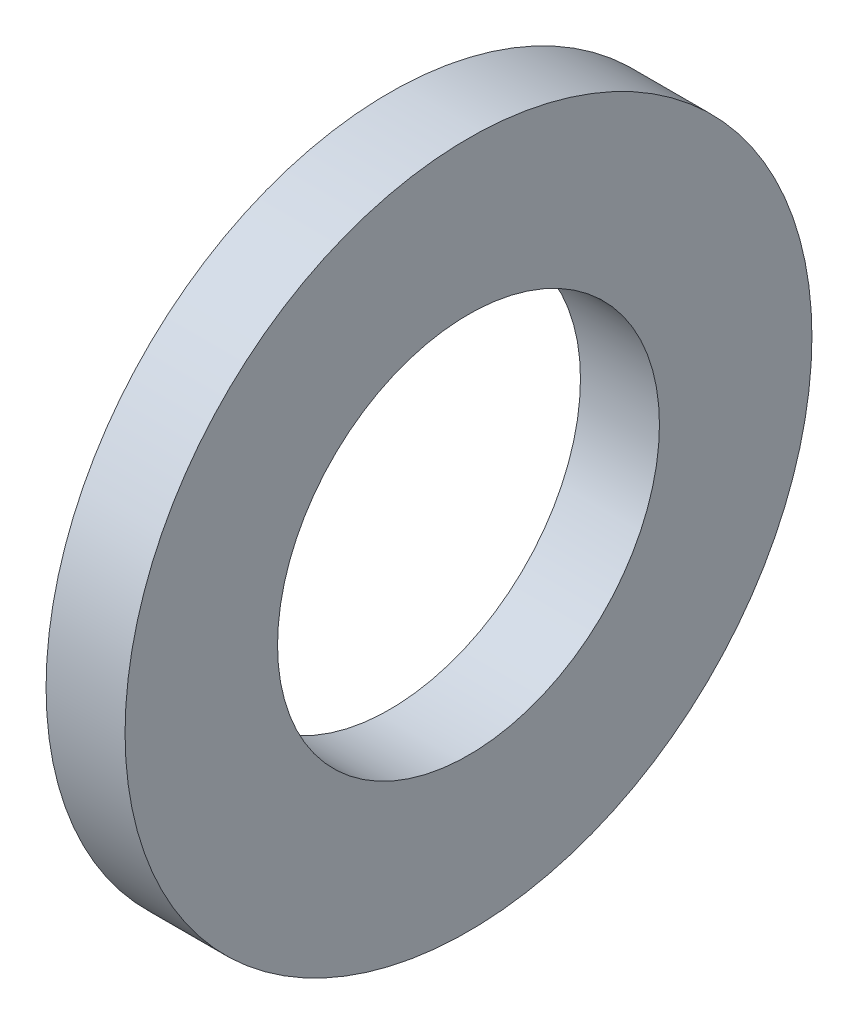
ISO-10303-21;
HEADER;
FILE_DESCRIPTION(('STEP AP214'),'2;1');
FILE_NAME('part.step','',(''),(''),'','','');
FILE_SCHEMA(('AUTOMOTIVE_DESIGN { 1 0 10303 214 1 1 1 1 }'));
ENDSEC;
DATA;
#1=APPLICATION_CONTEXT('core data for automotive mechanical design processes');
#2=APPLICATION_PROTOCOL_DEFINITION('international standard','automotive_design',2000,#1);
#3=PRODUCT_CONTEXT('',#1,'mechanical');
#4=PRODUCT('Part','Part','',(#3));
#5=PRODUCT_RELATED_PRODUCT_CATEGORY('part','',(#4));
#6=PRODUCT_DEFINITION_FORMATION('','',#4);
#7=PRODUCT_DEFINITION_CONTEXT('part definition',#1,'design');
#8=PRODUCT_DEFINITION('design','',#6,#7);
#9=PRODUCT_DEFINITION_SHAPE('','',#8);
#10=(LENGTH_UNIT() NAMED_UNIT(*) SI_UNIT(.MILLI.,.METRE.));
#11=(NAMED_UNIT(*) PLANE_ANGLE_UNIT() SI_UNIT($,.RADIAN.));
#12=(NAMED_UNIT(*) SI_UNIT($,.STERADIAN.) SOLID_ANGLE_UNIT());
#13=UNCERTAINTY_MEASURE_WITH_UNIT(LENGTH_MEASURE(1.E-05),#10,'distance_accuracy_value','');
#14=(GEOMETRIC_REPRESENTATION_CONTEXT(3) GLOBAL_UNCERTAINTY_ASSIGNED_CONTEXT((#13)) GLOBAL_UNIT_ASSIGNED_CONTEXT((#10,
#11,#12)) REPRESENTATION_CONTEXT('',''));
#15=CARTESIAN_POINT('',(0.,0.,0.));
#16=DIRECTION('',(0.,0.,1.));
#17=DIRECTION('',(1.,0.,0.));
#18=AXIS2_PLACEMENT_3D('',#15,#16,#17);
#19=CARTESIAN_POINT('',(-34.9249999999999,0.,0.));
#20=DIRECTION('',(-1.,0.,0.));
#21=DIRECTION('',(0.,0.,1.));
#22=AXIS2_PLACEMENT_3D('',#19,#20,#21);
#23=CYLINDRICAL_SURFACE('',#22,5.56);
#24=CARTESIAN_POINT('',(0.,0.,0.));
#25=DIRECTION('',(-1.,0.,0.));
#26=DIRECTION('',(0.,0.,1.));
#27=AXIS2_PLACEMENT_3D('',#24,#25,#26);
#28=CIRCLE('',#27,5.56);
#29=CARTESIAN_POINT('',(0.,0.,5.56));
#30=VERTEX_POINT('',#29);
#31=EDGE_CURVE('E10',#30,#30,#28,.T.);
#32=ORIENTED_EDGE('',*,*,#31,.F.);
#33=EDGE_LOOP('',(#32));
#34=FACE_BOUND('',#33,.T.);
#35=CARTESIAN_POINT('',(-2.3,0.,0.));
#36=DIRECTION('',(-1.,0.,0.));
#37=DIRECTION('',(0.,0.,1.));
#38=AXIS2_PLACEMENT_3D('',#35,#36,#37);
#39=CIRCLE('',#38,5.56);
#40=CARTESIAN_POINT('',(-2.3,0.,5.56));
#41=VERTEX_POINT('',#40);
#42=EDGE_CURVE('E43',#41,#41,#39,.T.);
#43=ORIENTED_EDGE('',*,*,#42,.T.);
#44=EDGE_LOOP('',(#43));
#45=FACE_BOUND('',#44,.T.);
#46=ADVANCED_FACE('F29',(#34,#45),#23,.F.);
#47=CARTESIAN_POINT('',(0.,5.56,0.));
#48=DIRECTION('',(-1.,0.,0.));
#49=DIRECTION('',(0.,0.,1.));
#50=AXIS2_PLACEMENT_3D('',#47,#48,#49);
#51=PLANE('',#50);
#52=CARTESIAN_POINT('',(0.,0.,0.));
#53=DIRECTION('',(-1.,0.,0.));
#54=DIRECTION('',(0.,0.,1.));
#55=AXIS2_PLACEMENT_3D('',#52,#53,#54);
#56=CIRCLE('',#55,10.);
#57=CARTESIAN_POINT('',(0.,0.,10.));
#58=VERTEX_POINT('',#57);
#59=EDGE_CURVE('E35',#58,#58,#56,.T.);
#60=ORIENTED_EDGE('',*,*,#59,.F.);
#61=EDGE_LOOP('',(#60));
#62=FACE_BOUND('',#61,.T.);
#63=ORIENTED_EDGE('',*,*,#31,.T.);
#64=EDGE_LOOP('',(#63));
#65=FACE_BOUND('',#64,.T.);
#66=ADVANCED_FACE('F58',(#62,#65),#51,.F.);
#67=CARTESIAN_POINT('',(-34.9249999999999,0.,0.));
#68=DIRECTION('',(-1.,0.,0.));
#69=DIRECTION('',(0.,0.,1.));
#70=AXIS2_PLACEMENT_3D('',#67,#68,#69);
#71=CYLINDRICAL_SURFACE('',#70,10.);
#72=CARTESIAN_POINT('',(-2.3,0.,0.));
#73=DIRECTION('',(-1.,0.,0.));
#74=DIRECTION('',(0.,0.,1.));
#75=AXIS2_PLACEMENT_3D('',#72,#73,#74);
#76=CIRCLE('',#75,10.);
#77=CARTESIAN_POINT('',(-2.3,0.,10.));
#78=VERTEX_POINT('',#77);
#79=EDGE_CURVE('E39',#78,#78,#76,.T.);
#80=ORIENTED_EDGE('',*,*,#79,.F.);
#81=EDGE_LOOP('',(#80));
#82=FACE_BOUND('',#81,.T.);
#83=ORIENTED_EDGE('',*,*,#59,.T.);
#84=EDGE_LOOP('',(#83));
#85=FACE_BOUND('',#84,.T.);
#86=ADVANCED_FACE('F53',(#82,#85),#71,.T.);
#87=CARTESIAN_POINT('',(-2.3,10.,0.));
#88=DIRECTION('',(1.,0.,0.));
#89=DIRECTION('',(0.,0.,-1.));
#90=AXIS2_PLACEMENT_3D('',#87,#88,#89);
#91=PLANE('',#90);
#92=ORIENTED_EDGE('',*,*,#42,.F.);
#93=EDGE_LOOP('',(#92));
#94=FACE_BOUND('',#93,.T.);
#95=ORIENTED_EDGE('',*,*,#79,.T.);
#96=EDGE_LOOP('',(#95));
#97=FACE_BOUND('',#96,.T.);
#98=ADVANCED_FACE('F50',(#94,#97),#91,.F.);
#99=CLOSED_SHELL('',(#46,#66,#86,#98));
#100=MANIFOLD_SOLID_BREP('B2',#99);
#101=ADVANCED_BREP_SHAPE_REPRESENTATION('',(#18,#100),#14);
#102=SHAPE_DEFINITION_REPRESENTATION(#9,#101);
ENDSEC;
END-ISO-10303-21;
